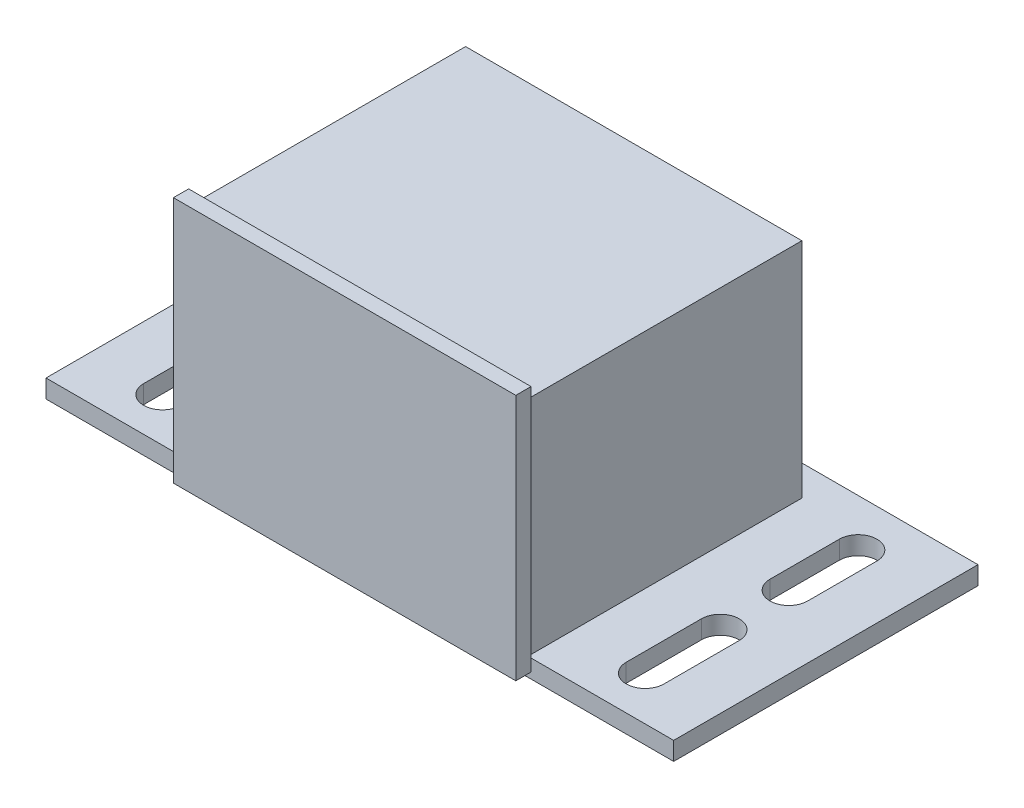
from build123d import *

# Parameters (mm, degrees)
SKETCH1_W           = 52.3875
SKETCH1_H           = 25.4
BOSS_EXTRUDE1_DEPTH = 1.524
SKETCH2_W           = 28.067
SKETCH2_H           = 20.1295
BOSS_EXTRUDE2_DEPTH = 22.86
SKETCH3_W           = 28.575
SKETCH3_H           = 20.6375
BOSS_EXTRUDE3_DEPTH = 1.27
CUT_EXTRUDE1_DEPTH  = 36.584781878


with BuildPart() as part:
    # Sketch1 → Boss-Extrude1 (new body)
    with BuildSketch(Plane(origin=(0, 0, 0), x_dir=(1, 0, 0), z_dir=(0, 1, 0))):
        Rectangle(SKETCH1_W, SKETCH1_H)
    extrude(amount=BOSS_EXTRUDE1_DEPTH)

    # Sketch2 → Boss-Extrude2 (add)
    with BuildSketch(Plane.XY.offset(12.7)):
        with Locations((0, 10.06475)):
            Rectangle(SKETCH2_W, SKETCH2_H)
    extrude(amount=-BOSS_EXTRUDE2_DEPTH)

    # Sketch3 → Boss-Extrude3 (add)
    with BuildSketch(Plane.XY.offset(12.7)):
        with Locations((0, 10.82675)):
            Rectangle(SKETCH3_W, SKETCH3_H)
    extrude(amount=BOSS_EXTRUDE3_DEPTH)

    # Sketch4 → Cut-Extrude1 (cut, through all)
    with BuildSketch(Plane(origin=(0, 1.524, 0), x_dir=(1, 0, 0), z_dir=(0, 1, 0))):
        with BuildLine():
            Line((-18.563124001, 8.754266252), (-18.563124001, 2.965254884))
            ThreePointArc((-18.563124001, 2.965254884), (-20.137924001, 1.390454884), (-21.712724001, 2.965254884))
            Line((-21.712724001, 2.965254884), (-21.712724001, 8.754266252))
            ThreePointArc((-21.712724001, 8.754266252), (-20.137924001, 10.329066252), (-18.563124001, 8.754266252))
        make_face()
        with BuildLine():
            Line((-18.563124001, -2.749745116), (-18.563124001, -9.028229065))
            ThreePointArc((-18.563124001, -9.028229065), (-20.137924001, -10.603029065), (-21.712724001, -9.028229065))
            Line((-21.712724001, -9.028229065), (-21.712724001, -2.749745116))
            ThreePointArc((-21.712724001, -2.749745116), (-20.137924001, -1.174945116), (-18.563124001, -2.749745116))
        make_face()
    cut_extrude1 = extrude(amount=-CUT_EXTRUDE1_DEPTH, mode=Mode.SUBTRACT)

    # Mirror1: Cut-Extrude1 across plane
    add(cut_extrude1.mirror(Plane(origin=(0, 0, 0), x_dir=(0, 0, 1), z_dir=(1, 0, 0))), mode=Mode.SUBTRACT)


solid = part.part
